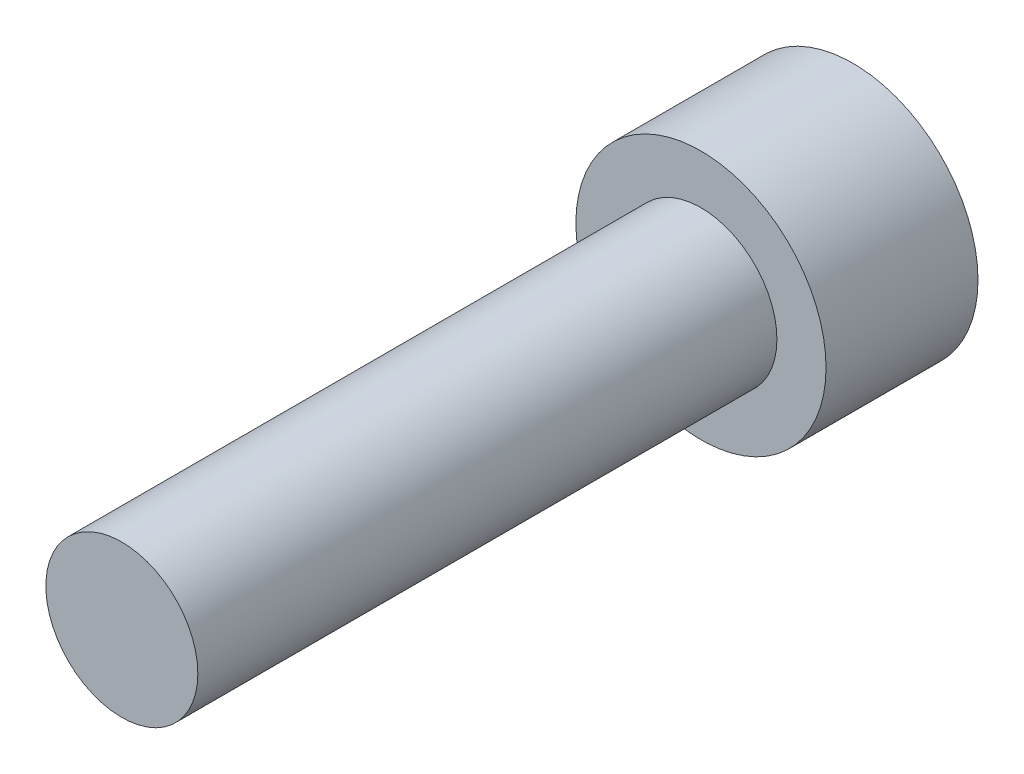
from build123d import *

# Parameters (mm, degrees)
HEX_2_DEPTH = 2.794


with BuildPart() as part:
    # Sketch6 → Revolve1 (revolve)
    with BuildSketch(Plane(origin=(0, 0, 0), x_dir=(0, 0, -1), z_dir=(1, 0, 0)), mode=Mode.PRIVATE) as revolve1_sk:
        Polygon((-15.875, 0), (-15.875, -2.0828), (0, -2.0828), (0, -3.429), (4.1656, -3.429), (4.1656, 0), align=None)
    revolve(revolve1_sk.sketch.rotate(Axis((0, 0, 15.875), (0, 0, -1)), 270), axis=Axis((0, 0, 15.875), (0, 0, -1)))

    # Sketch7 → HEX 2 (cut)
    with BuildSketch(Plane(origin=(0, 0, -4.1656), x_dir=(-1, 0, 0), z_dir=(0, 0, -1))):
        Polygon((-1.778, 1.026528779), (-1.778, -1.026528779), (0, -2.053057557), (1.778, -1.026528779), (1.778, 1.026528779), (0, 2.053057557), align=None)
    extrude(amount=-HEX_2_DEPTH, mode=Mode.SUBTRACT)


solid = part.part
